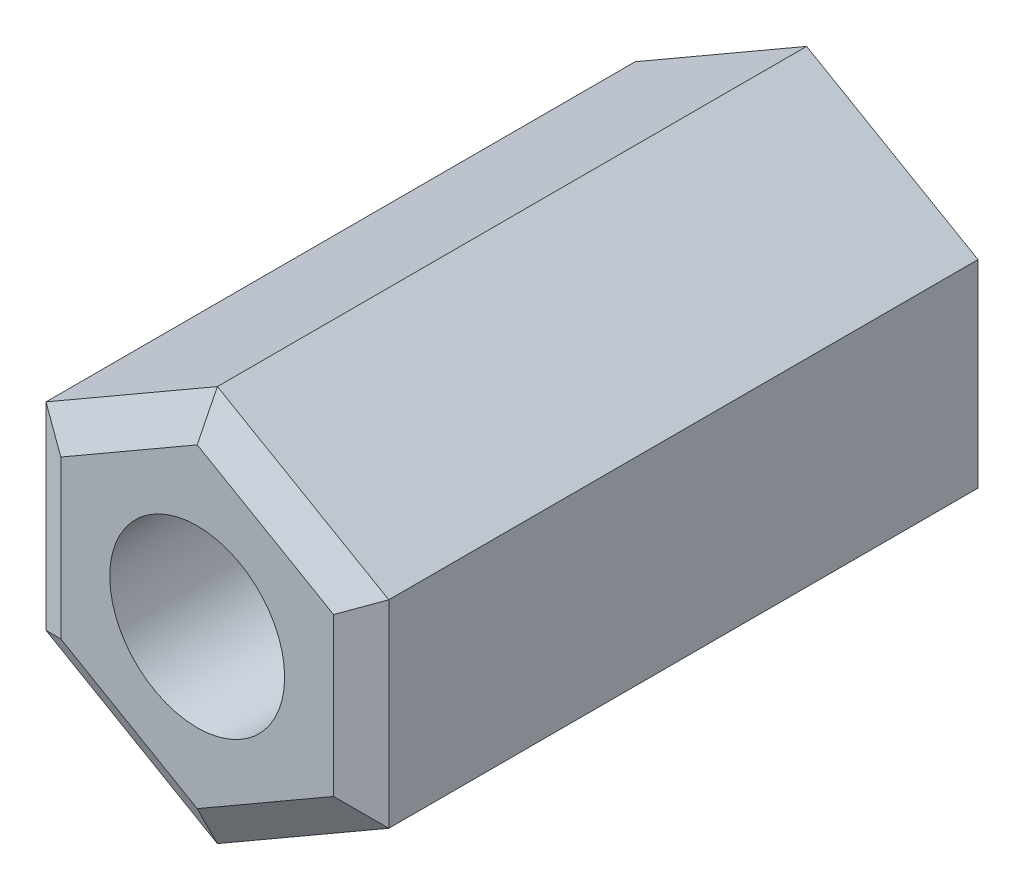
ISO-10303-21;
HEADER;
FILE_DESCRIPTION(('STEP AP214'),'2;1');
FILE_NAME('part.step','',(''),(''),'','','');
FILE_SCHEMA(('AUTOMOTIVE_DESIGN { 1 0 10303 214 1 1 1 1 }'));
ENDSEC;
DATA;
#1=APPLICATION_CONTEXT('core data for automotive mechanical design processes');
#2=APPLICATION_PROTOCOL_DEFINITION('international standard','automotive_design',2000,#1);
#3=PRODUCT_CONTEXT('',#1,'mechanical');
#4=PRODUCT('Part','Part','',(#3));
#5=PRODUCT_RELATED_PRODUCT_CATEGORY('part','',(#4));
#6=PRODUCT_DEFINITION_FORMATION('','',#4);
#7=PRODUCT_DEFINITION_CONTEXT('part definition',#1,'design');
#8=PRODUCT_DEFINITION('design','',#6,#7);
#9=PRODUCT_DEFINITION_SHAPE('','',#8);
#10=(LENGTH_UNIT() NAMED_UNIT(*) SI_UNIT(.MILLI.,.METRE.));
#11=(NAMED_UNIT(*) PLANE_ANGLE_UNIT() SI_UNIT($,.RADIAN.));
#12=(NAMED_UNIT(*) SI_UNIT($,.STERADIAN.) SOLID_ANGLE_UNIT());
#13=UNCERTAINTY_MEASURE_WITH_UNIT(LENGTH_MEASURE(1.E-05),#10,'distance_accuracy_value','');
#14=(GEOMETRIC_REPRESENTATION_CONTEXT(3) GLOBAL_UNCERTAINTY_ASSIGNED_CONTEXT((#13)) GLOBAL_UNIT_ASSIGNED_CONTEXT((#10,
#11,#12)) REPRESENTATION_CONTEXT('',''));
#15=CARTESIAN_POINT('',(0.,0.,0.));
#16=DIRECTION('',(0.,0.,1.));
#17=DIRECTION('',(1.,0.,0.));
#18=AXIS2_PLACEMENT_3D('',#15,#16,#17);
#19=CARTESIAN_POINT('',(0.,-5.65803263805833,18.));
#20=DIRECTION('',(-0.5,0.866025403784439,0.));
#21=DIRECTION('',(-0.866025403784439,-0.5,0.));
#22=AXIS2_PLACEMENT_3D('',#19,#20,#21);
#23=PLANE('',#22);
#24=DIRECTION('',(0.,0.,-1.));
#25=VECTOR('',#24,1.);
#26=CARTESIAN_POINT('',(0.,-5.65803263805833,18.));
#27=LINE('',#26,#25);
#28=CARTESIAN_POINT('',(0.,-5.65803263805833,17.4226497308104));
#29=VERTEX_POINT('',#28);
#30=CARTESIAN_POINT('',(0.,-5.65803263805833,0.577350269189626));
#31=VERTEX_POINT('',#30);
#32=EDGE_CURVE('E296',#29,#31,#27,.T.);
#33=ORIENTED_EDGE('',*,*,#32,.T.);
#34=DIRECTION('',(0.866025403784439,0.5,0.));
#35=VECTOR('',#34,1.);
#36=CARTESIAN_POINT('',(0.,-5.65803263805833,0.577350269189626));
#37=LINE('',#36,#35);
#38=CARTESIAN_POINT('',(4.9,-2.82901631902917,0.577350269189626));
#39=VERTEX_POINT('',#38);
#40=EDGE_CURVE('E198',#31,#39,#37,.T.);
#41=ORIENTED_EDGE('',*,*,#40,.T.);
#42=DIRECTION('',(0.,0.,-1.));
#43=VECTOR('',#42,1.);
#44=CARTESIAN_POINT('',(4.9,-2.82901631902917,18.));
#45=LINE('',#44,#43);
#46=CARTESIAN_POINT('',(4.9,-2.82901631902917,17.4226497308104));
#47=VERTEX_POINT('',#46);
#48=EDGE_CURVE('E168',#47,#39,#45,.T.);
#49=ORIENTED_EDGE('',*,*,#48,.F.);
#50=DIRECTION('',(-0.866025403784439,-0.5,0.));
#51=VECTOR('',#50,1.);
#52=CARTESIAN_POINT('',(0.,-5.65803263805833,17.4226497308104));
#53=LINE('',#52,#51);
#54=EDGE_CURVE('E179',#47,#29,#53,.T.);
#55=ORIENTED_EDGE('',*,*,#54,.T.);
#56=EDGE_LOOP('',(#33,#41,#49,#55));
#57=FACE_BOUND('',#56,.T.);
#58=ADVANCED_FACE('F53',(#57),#23,.F.);
#59=CARTESIAN_POINT('',(4.9,-2.82901631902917,18.));
#60=DIRECTION('',(-1.,0.,0.));
#61=DIRECTION('',(0.,-1.,0.));
#62=AXIS2_PLACEMENT_3D('',#59,#60,#61);
#63=PLANE('',#62);
#64=ORIENTED_EDGE('',*,*,#48,.T.);
#65=DIRECTION('',(0.,1.,0.));
#66=VECTOR('',#65,1.);
#67=CARTESIAN_POINT('',(4.9,-2.82901631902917,0.577350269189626));
#68=LINE('',#67,#66);
#69=CARTESIAN_POINT('',(4.9,2.82901631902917,0.577350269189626));
#70=VERTEX_POINT('',#69);
#71=EDGE_CURVE('E11',#39,#70,#68,.T.);
#72=ORIENTED_EDGE('',*,*,#71,.T.);
#73=DIRECTION('',(0.,0.,-1.));
#74=VECTOR('',#73,1.);
#75=CARTESIAN_POINT('',(4.9,2.82901631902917,18.));
#76=LINE('',#75,#74);
#77=CARTESIAN_POINT('',(4.9,2.82901631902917,17.4226497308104));
#78=VERTEX_POINT('',#77);
#79=EDGE_CURVE('E320',#78,#70,#76,.T.);
#80=ORIENTED_EDGE('',*,*,#79,.F.);
#81=DIRECTION('',(0.,-1.,0.));
#82=VECTOR('',#81,1.);
#83=CARTESIAN_POINT('',(4.9,-2.82901631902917,17.4226497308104));
#84=LINE('',#83,#82);
#85=EDGE_CURVE('E153',#78,#47,#84,.T.);
#86=ORIENTED_EDGE('',*,*,#85,.T.);
#87=EDGE_LOOP('',(#64,#72,#80,#86));
#88=FACE_BOUND('',#87,.T.);
#89=ADVANCED_FACE('F338',(#88),#63,.F.);
#90=CARTESIAN_POINT('',(4.9,2.82901631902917,18.));
#91=DIRECTION('',(-0.5,-0.866025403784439,0.));
#92=DIRECTION('',(0.866025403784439,-0.5,0.));
#93=AXIS2_PLACEMENT_3D('',#90,#91,#92);
#94=PLANE('',#93);
#95=ORIENTED_EDGE('',*,*,#79,.T.);
#96=DIRECTION('',(-0.866025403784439,0.5,0.));
#97=VECTOR('',#96,1.);
#98=CARTESIAN_POINT('',(4.9,2.82901631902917,0.577350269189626));
#99=LINE('',#98,#97);
#100=CARTESIAN_POINT('',(0.,5.65803263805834,0.577350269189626));
#101=VERTEX_POINT('',#100);
#102=EDGE_CURVE('E64',#70,#101,#99,.T.);
#103=ORIENTED_EDGE('',*,*,#102,.T.);
#104=DIRECTION('',(0.,0.,-1.));
#105=VECTOR('',#104,1.);
#106=CARTESIAN_POINT('',(0.,5.65803263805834,18.));
#107=LINE('',#106,#105);
#108=CARTESIAN_POINT('',(0.,5.65803263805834,17.4226497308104));
#109=VERTEX_POINT('',#108);
#110=EDGE_CURVE('E317',#109,#101,#107,.T.);
#111=ORIENTED_EDGE('',*,*,#110,.F.);
#112=DIRECTION('',(0.866025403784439,-0.5,0.));
#113=VECTOR('',#112,1.);
#114=CARTESIAN_POINT('',(4.9,2.82901631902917,17.4226497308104));
#115=LINE('',#114,#113);
#116=EDGE_CURVE('E196',#109,#78,#115,.T.);
#117=ORIENTED_EDGE('',*,*,#116,.T.);
#118=EDGE_LOOP('',(#95,#103,#111,#117));
#119=FACE_BOUND('',#118,.T.);
#120=ADVANCED_FACE('F339',(#119),#94,.F.);
#121=CARTESIAN_POINT('',(0.,5.65803263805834,18.));
#122=DIRECTION('',(0.5,-0.866025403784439,0.));
#123=DIRECTION('',(0.866025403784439,0.5,0.));
#124=AXIS2_PLACEMENT_3D('',#121,#122,#123);
#125=PLANE('',#124);
#126=ORIENTED_EDGE('',*,*,#110,.T.);
#127=DIRECTION('',(-0.866025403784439,-0.5,0.));
#128=VECTOR('',#127,1.);
#129=CARTESIAN_POINT('',(0.,5.65803263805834,0.577350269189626));
#130=LINE('',#129,#128);
#131=CARTESIAN_POINT('',(-4.9,2.82901631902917,0.577350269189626));
#132=VERTEX_POINT('',#131);
#133=EDGE_CURVE('E245',#101,#132,#130,.T.);
#134=ORIENTED_EDGE('',*,*,#133,.T.);
#135=DIRECTION('',(0.,0.,-1.));
#136=VECTOR('',#135,1.);
#137=CARTESIAN_POINT('',(-4.9,2.82901631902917,18.));
#138=LINE('',#137,#136);
#139=CARTESIAN_POINT('',(-4.9,2.82901631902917,17.4226497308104));
#140=VERTEX_POINT('',#139);
#141=EDGE_CURVE('E308',#140,#132,#138,.T.);
#142=ORIENTED_EDGE('',*,*,#141,.F.);
#143=DIRECTION('',(0.866025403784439,0.5,0.));
#144=VECTOR('',#143,1.);
#145=CARTESIAN_POINT('',(0.,5.65803263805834,17.4226497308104));
#146=LINE('',#145,#144);
#147=EDGE_CURVE('E193',#140,#109,#146,.T.);
#148=ORIENTED_EDGE('',*,*,#147,.T.);
#149=EDGE_LOOP('',(#126,#134,#142,#148));
#150=FACE_BOUND('',#149,.T.);
#151=ADVANCED_FACE('F407',(#150),#125,.F.);
#152=CARTESIAN_POINT('',(-4.9,2.82901631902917,18.));
#153=DIRECTION('',(1.,0.,0.));
#154=DIRECTION('',(0.,1.,0.));
#155=AXIS2_PLACEMENT_3D('',#152,#153,#154);
#156=PLANE('',#155);
#157=ORIENTED_EDGE('',*,*,#141,.T.);
#158=DIRECTION('',(0.,-1.,0.));
#159=VECTOR('',#158,1.);
#160=CARTESIAN_POINT('',(-4.9,2.82901631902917,0.577350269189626));
#161=LINE('',#160,#159);
#162=CARTESIAN_POINT('',(-4.9,-2.82901631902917,0.577350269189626));
#163=VERTEX_POINT('',#162);
#164=EDGE_CURVE('E242',#132,#163,#161,.T.);
#165=ORIENTED_EDGE('',*,*,#164,.T.);
#166=DIRECTION('',(0.,0.,-1.));
#167=VECTOR('',#166,1.);
#168=CARTESIAN_POINT('',(-4.9,-2.82901631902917,18.));
#169=LINE('',#168,#167);
#170=CARTESIAN_POINT('',(-4.9,-2.82901631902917,17.4226497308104));
#171=VERTEX_POINT('',#170);
#172=EDGE_CURVE('E299',#171,#163,#169,.T.);
#173=ORIENTED_EDGE('',*,*,#172,.F.);
#174=DIRECTION('',(0.,1.,0.));
#175=VECTOR('',#174,1.);
#176=CARTESIAN_POINT('',(-4.9,2.82901631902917,17.4226497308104));
#177=LINE('',#176,#175);
#178=EDGE_CURVE('E190',#171,#140,#177,.T.);
#179=ORIENTED_EDGE('',*,*,#178,.T.);
#180=EDGE_LOOP('',(#157,#165,#173,#179));
#181=FACE_BOUND('',#180,.T.);
#182=ADVANCED_FACE('F409',(#181),#156,.F.);
#183=CARTESIAN_POINT('',(-4.9,-2.82901631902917,18.));
#184=DIRECTION('',(0.5,0.866025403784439,0.));
#185=DIRECTION('',(-0.866025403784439,0.5,0.));
#186=AXIS2_PLACEMENT_3D('',#183,#184,#185);
#187=PLANE('',#186);
#188=ORIENTED_EDGE('',*,*,#172,.T.);
#189=DIRECTION('',(0.866025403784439,-0.5,0.));
#190=VECTOR('',#189,1.);
#191=CARTESIAN_POINT('',(-4.9,-2.82901631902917,0.577350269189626));
#192=LINE('',#191,#190);
#193=EDGE_CURVE('E239',#163,#31,#192,.T.);
#194=ORIENTED_EDGE('',*,*,#193,.T.);
#195=ORIENTED_EDGE('',*,*,#32,.F.);
#196=DIRECTION('',(-0.866025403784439,0.5,0.));
#197=VECTOR('',#196,1.);
#198=CARTESIAN_POINT('',(-4.9,-2.82901631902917,17.4226497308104));
#199=LINE('',#198,#197);
#200=EDGE_CURVE('E187',#29,#171,#199,.T.);
#201=ORIENTED_EDGE('',*,*,#200,.T.);
#202=EDGE_LOOP('',(#188,#194,#195,#201));
#203=FACE_BOUND('',#202,.T.);
#204=ADVANCED_FACE('F295',(#203),#187,.F.);
#205=CARTESIAN_POINT('',(0.,0.,18.));
#206=DIRECTION('',(0.,0.,1.));
#207=DIRECTION('',(1.,0.,0.));
#208=AXIS2_PLACEMENT_3D('',#205,#206,#207);
#209=PLANE('',#208);
#210=DIRECTION('',(0.866025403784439,0.5,0.));
#211=VECTOR('',#210,1.);
#212=CARTESIAN_POINT('',(4.4,-1.96299091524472,18.));
#213=LINE('',#212,#211);
#214=CARTESIAN_POINT('',(0.,-4.50333209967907,18.));
#215=VERTEX_POINT('',#214);
#216=CARTESIAN_POINT('',(3.89999999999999,-2.25166604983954,18.));
#217=VERTEX_POINT('',#216);
#218=EDGE_CURVE('E173',#215,#217,#213,.T.);
#219=ORIENTED_EDGE('',*,*,#218,.T.);
#220=DIRECTION('',(0.,1.,0.));
#221=VECTOR('',#220,1.);
#222=CARTESIAN_POINT('',(3.89999999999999,2.82901631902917,18.));
#223=LINE('',#222,#221);
#224=CARTESIAN_POINT('',(3.89999999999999,2.25166604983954,18.));
#225=VERTEX_POINT('',#224);
#226=EDGE_CURVE('E151',#217,#225,#223,.T.);
#227=ORIENTED_EDGE('',*,*,#226,.T.);
#228=DIRECTION('',(-0.866025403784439,0.5,0.));
#229=VECTOR('',#228,1.);
#230=CARTESIAN_POINT('',(-0.500000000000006,4.79200723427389,18.));
#231=LINE('',#230,#229);
#232=CARTESIAN_POINT('',(0.,4.50333209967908,18.));
#233=VERTEX_POINT('',#232);
#234=EDGE_CURVE('E160',#225,#233,#231,.T.);
#235=ORIENTED_EDGE('',*,*,#234,.T.);
#236=DIRECTION('',(-0.866025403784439,-0.5,0.));
#237=VECTOR('',#236,1.);
#238=CARTESIAN_POINT('',(-4.4,1.96299091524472,18.));
#239=LINE('',#238,#237);
#240=CARTESIAN_POINT('',(-3.89999999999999,2.25166604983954,18.));
#241=VERTEX_POINT('',#240);
#242=EDGE_CURVE('E167',#233,#241,#239,.T.);
#243=ORIENTED_EDGE('',*,*,#242,.T.);
#244=DIRECTION('',(0.,-1.,0.));
#245=VECTOR('',#244,1.);
#246=CARTESIAN_POINT('',(-3.89999999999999,-2.82901631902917,18.));
#247=LINE('',#246,#245);
#248=CARTESIAN_POINT('',(-3.89999999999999,-2.25166604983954,18.));
#249=VERTEX_POINT('',#248);
#250=EDGE_CURVE('E327',#241,#249,#247,.T.);
#251=ORIENTED_EDGE('',*,*,#250,.T.);
#252=DIRECTION('',(0.866025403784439,-0.5,0.));
#253=VECTOR('',#252,1.);
#254=CARTESIAN_POINT('',(0.500000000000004,-4.79200723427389,18.));
#255=LINE('',#254,#253);
#256=EDGE_CURVE('E181',#249,#215,#255,.T.);
#257=ORIENTED_EDGE('',*,*,#256,.T.);
#258=EDGE_LOOP('',(#219,#227,#235,#243,#251,#257));
#259=FACE_BOUND('',#258,.T.);
#260=CARTESIAN_POINT('',(0.,0.,18.));
#261=DIRECTION('',(0.,0.,1.));
#262=DIRECTION('',(1.,0.,0.));
#263=AXIS2_PLACEMENT_3D('',#260,#261,#262);
#264=CIRCLE('',#263,2.5);
#265=CARTESIAN_POINT('',(2.5,0.,18.));
#266=VERTEX_POINT('',#265);
#267=EDGE_CURVE('E216',#266,#266,#264,.T.);
#268=ORIENTED_EDGE('',*,*,#267,.F.);
#269=EDGE_LOOP('',(#268));
#270=FACE_BOUND('',#269,.T.);
#271=ADVANCED_FACE('F170',(#259,#270),#209,.T.);
#272=CARTESIAN_POINT('',(0.,0.,0.));
#273=DIRECTION('',(0.,0.,1.));
#274=DIRECTION('',(1.,0.,0.));
#275=AXIS2_PLACEMENT_3D('',#272,#273,#274);
#276=PLANE('',#275);
#277=DIRECTION('',(0.,-1.,0.));
#278=VECTOR('',#277,1.);
#279=CARTESIAN_POINT('',(3.89999999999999,0.,0.));
#280=LINE('',#279,#278);
#281=CARTESIAN_POINT('',(3.89999999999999,2.25166604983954,0.));
#282=VERTEX_POINT('',#281);
#283=CARTESIAN_POINT('',(3.89999999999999,-2.25166604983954,0.));
#284=VERTEX_POINT('',#283);
#285=EDGE_CURVE('E220',#282,#284,#280,.T.);
#286=ORIENTED_EDGE('',*,*,#285,.T.);
#287=DIRECTION('',(-0.866025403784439,-0.5,0.));
#288=VECTOR('',#287,1.);
#289=CARTESIAN_POINT('',(1.95,-3.37749907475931,0.));
#290=LINE('',#289,#288);
#291=CARTESIAN_POINT('',(0.,-4.50333209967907,0.));
#292=VERTEX_POINT('',#291);
#293=EDGE_CURVE('E235',#284,#292,#290,.T.);
#294=ORIENTED_EDGE('',*,*,#293,.T.);
#295=DIRECTION('',(-0.866025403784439,0.5,0.));
#296=VECTOR('',#295,1.);
#297=CARTESIAN_POINT('',(-1.95,-3.37749907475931,0.));
#298=LINE('',#297,#296);
#299=CARTESIAN_POINT('',(-3.89999999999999,-2.25166604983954,0.));
#300=VERTEX_POINT('',#299);
#301=EDGE_CURVE('E232',#292,#300,#298,.T.);
#302=ORIENTED_EDGE('',*,*,#301,.T.);
#303=DIRECTION('',(0.,1.,0.));
#304=VECTOR('',#303,1.);
#305=CARTESIAN_POINT('',(-3.89999999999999,0.,0.));
#306=LINE('',#305,#304);
#307=CARTESIAN_POINT('',(-3.89999999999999,2.25166604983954,0.));
#308=VERTEX_POINT('',#307);
#309=EDGE_CURVE('E229',#300,#308,#306,.T.);
#310=ORIENTED_EDGE('',*,*,#309,.T.);
#311=DIRECTION('',(0.866025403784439,0.5,0.));
#312=VECTOR('',#311,1.);
#313=CARTESIAN_POINT('',(-1.95,3.37749907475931,0.));
#314=LINE('',#313,#312);
#315=CARTESIAN_POINT('',(0.,4.50333209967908,0.));
#316=VERTEX_POINT('',#315);
#317=EDGE_CURVE('E226',#308,#316,#314,.T.);
#318=ORIENTED_EDGE('',*,*,#317,.T.);
#319=DIRECTION('',(0.866025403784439,-0.5,0.));
#320=VECTOR('',#319,1.);
#321=CARTESIAN_POINT('',(1.95,3.37749907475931,0.));
#322=LINE('',#321,#320);
#323=EDGE_CURVE('E223',#316,#282,#322,.T.);
#324=ORIENTED_EDGE('',*,*,#323,.T.);
#325=EDGE_LOOP('',(#286,#294,#302,#310,#318,#324));
#326=FACE_BOUND('',#325,.T.);
#327=CARTESIAN_POINT('',(0.,0.,0.));
#328=DIRECTION('',(0.,0.,1.));
#329=DIRECTION('',(1.,0.,0.));
#330=AXIS2_PLACEMENT_3D('',#327,#328,#329);
#331=CIRCLE('',#330,2.5);
#332=CARTESIAN_POINT('',(2.5,0.,0.));
#333=VERTEX_POINT('',#332);
#334=EDGE_CURVE('E304',#333,#333,#331,.T.);
#335=ORIENTED_EDGE('',*,*,#334,.T.);
#336=EDGE_LOOP('',(#335));
#337=FACE_BOUND('',#336,.T.);
#338=ADVANCED_FACE('F281',(#326,#337),#276,.F.);
#339=CARTESIAN_POINT('',(0.,0.,18.));
#340=DIRECTION('',(0.,0.,1.));
#341=DIRECTION('',(1.,0.,0.));
#342=AXIS2_PLACEMENT_3D('',#339,#340,#341);
#343=CYLINDRICAL_SURFACE('',#342,2.5);
#344=ORIENTED_EDGE('',*,*,#334,.F.);
#345=EDGE_LOOP('',(#344));
#346=FACE_BOUND('',#345,.T.);
#347=ORIENTED_EDGE('',*,*,#267,.T.);
#348=EDGE_LOOP('',(#347));
#349=FACE_BOUND('',#348,.T.);
#350=ADVANCED_FACE('F394',(#346,#349),#343,.F.);
#351=CARTESIAN_POINT('',(-3.89999999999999,0.,18.));
#352=DIRECTION('',(-0.499999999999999,0.,0.866025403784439));
#353=DIRECTION('',(0.,1.,0.));
#354=AXIS2_PLACEMENT_3D('',#351,#352,#353);
#355=PLANE('',#354);
#356=DIRECTION('',(0.774596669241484,-0.447213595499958,0.447213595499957));
#357=VECTOR('',#356,1.);
#358=CARTESIAN_POINT('',(-3.11999999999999,1.80133283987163,18.4503332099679));
#359=LINE('',#358,#357);
#360=EDGE_CURVE('E208',#140,#241,#359,.T.);
#361=ORIENTED_EDGE('',*,*,#360,.F.);
#362=ORIENTED_EDGE('',*,*,#178,.F.);
#363=DIRECTION('',(0.774596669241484,0.447213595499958,0.447213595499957));
#364=VECTOR('',#363,1.);
#365=CARTESIAN_POINT('',(-3.11999999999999,-1.80133283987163,18.4503332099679));
#366=LINE('',#365,#364);
#367=EDGE_CURVE('E212',#249,#171,#366,.F.);
#368=ORIENTED_EDGE('',*,*,#367,.F.);
#369=ORIENTED_EDGE('',*,*,#250,.F.);
#370=EDGE_LOOP('',(#361,#362,#368,#369));
#371=FACE_BOUND('',#370,.T.);
#372=ADVANCED_FACE('F390',(#371),#355,.T.);
#373=CARTESIAN_POINT('',(-1.95,-3.37749907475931,18.));
#374=DIRECTION('',(-0.25,-0.433012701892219,0.866025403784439));
#375=DIRECTION('',(-0.866025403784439,0.5,0.));
#376=AXIS2_PLACEMENT_3D('',#373,#374,#375);
#377=PLANE('',#376);
#378=ORIENTED_EDGE('',*,*,#367,.T.);
#379=ORIENTED_EDGE('',*,*,#200,.F.);
#380=DIRECTION('',(0.,0.894427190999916,0.447213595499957));
#381=VECTOR('',#380,1.);
#382=CARTESIAN_POINT('',(0.,-3.60266567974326,18.4503332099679));
#383=LINE('',#382,#381);
#384=EDGE_CURVE('E204',#215,#29,#383,.F.);
#385=ORIENTED_EDGE('',*,*,#384,.F.);
#386=ORIENTED_EDGE('',*,*,#256,.F.);
#387=EDGE_LOOP('',(#378,#379,#385,#386));
#388=FACE_BOUND('',#387,.T.);
#389=ADVANCED_FACE('F335',(#388),#377,.T.);
#390=CARTESIAN_POINT('',(-1.95,3.37749907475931,18.));
#391=DIRECTION('',(-0.25,0.433012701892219,0.866025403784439));
#392=DIRECTION('',(0.866025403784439,0.5,0.));
#393=AXIS2_PLACEMENT_3D('',#390,#391,#392);
#394=PLANE('',#393);
#395=ORIENTED_EDGE('',*,*,#360,.T.);
#396=ORIENTED_EDGE('',*,*,#242,.F.);
#397=DIRECTION('',(0.,-0.894427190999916,0.447213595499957));
#398=VECTOR('',#397,1.);
#399=CARTESIAN_POINT('',(0.,3.60266567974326,18.4503332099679));
#400=LINE('',#399,#398);
#401=EDGE_CURVE('E163',#109,#233,#400,.T.);
#402=ORIENTED_EDGE('',*,*,#401,.F.);
#403=ORIENTED_EDGE('',*,*,#147,.F.);
#404=EDGE_LOOP('',(#395,#396,#402,#403));
#405=FACE_BOUND('',#404,.T.);
#406=ADVANCED_FACE('F379',(#405),#394,.T.);
#407=CARTESIAN_POINT('',(1.95,-3.37749907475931,18.));
#408=DIRECTION('',(0.25,-0.433012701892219,0.866025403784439));
#409=DIRECTION('',(-0.866025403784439,-0.5,0.));
#410=AXIS2_PLACEMENT_3D('',#407,#408,#409);
#411=PLANE('',#410);
#412=ORIENTED_EDGE('',*,*,#384,.T.);
#413=ORIENTED_EDGE('',*,*,#54,.F.);
#414=DIRECTION('',(-0.774596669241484,0.447213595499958,0.447213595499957));
#415=VECTOR('',#414,1.);
#416=CARTESIAN_POINT('',(3.11999999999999,-1.80133283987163,18.4503332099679));
#417=LINE('',#416,#415);
#418=EDGE_CURVE('E157',#217,#47,#417,.F.);
#419=ORIENTED_EDGE('',*,*,#418,.F.);
#420=ORIENTED_EDGE('',*,*,#218,.F.);
#421=EDGE_LOOP('',(#412,#413,#419,#420));
#422=FACE_BOUND('',#421,.T.);
#423=ADVANCED_FACE('F337',(#422),#411,.T.);
#424=CARTESIAN_POINT('',(1.95,3.37749907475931,18.));
#425=DIRECTION('',(0.25,0.433012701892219,0.866025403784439));
#426=DIRECTION('',(0.866025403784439,-0.5,0.));
#427=AXIS2_PLACEMENT_3D('',#424,#425,#426);
#428=PLANE('',#427);
#429=ORIENTED_EDGE('',*,*,#401,.T.);
#430=ORIENTED_EDGE('',*,*,#234,.F.);
#431=DIRECTION('',(0.774596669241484,0.447213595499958,-0.447213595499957));
#432=VECTOR('',#431,1.);
#433=CARTESIAN_POINT('',(3.11999999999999,1.80133283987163,18.4503332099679));
#434=LINE('',#433,#432);
#435=EDGE_CURVE('E147',#78,#225,#434,.F.);
#436=ORIENTED_EDGE('',*,*,#435,.F.);
#437=ORIENTED_EDGE('',*,*,#116,.F.);
#438=EDGE_LOOP('',(#429,#430,#436,#437));
#439=FACE_BOUND('',#438,.T.);
#440=ADVANCED_FACE('F161',(#439),#428,.T.);
#441=CARTESIAN_POINT('',(3.89999999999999,0.,18.));
#442=DIRECTION('',(0.499999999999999,0.,0.866025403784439));
#443=DIRECTION('',(0.,-1.,0.));
#444=AXIS2_PLACEMENT_3D('',#441,#442,#443);
#445=PLANE('',#444);
#446=ORIENTED_EDGE('',*,*,#418,.T.);
#447=ORIENTED_EDGE('',*,*,#85,.F.);
#448=ORIENTED_EDGE('',*,*,#435,.T.);
#449=ORIENTED_EDGE('',*,*,#226,.F.);
#450=EDGE_LOOP('',(#446,#447,#448,#449));
#451=FACE_BOUND('',#450,.T.);
#452=ADVANCED_FACE('F149',(#451),#445,.T.);
#453=CARTESIAN_POINT('',(0.,5.65803263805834,0.577350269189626));
#454=DIRECTION('',(0.249999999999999,-0.433012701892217,0.86602540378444));
#455=DIRECTION('',(-0.866025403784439,-0.5,0.));
#456=AXIS2_PLACEMENT_3D('',#453,#454,#455);
#457=PLANE('',#456);
#458=DIRECTION('',(0.,0.894427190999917,0.447213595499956));
#459=VECTOR('',#458,1.);
#460=CARTESIAN_POINT('',(0.,3.394819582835,-0.554256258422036));
#461=LINE('',#460,#459);
#462=EDGE_CURVE('E263',#316,#101,#461,.T.);
#463=ORIENTED_EDGE('',*,*,#462,.F.);
#464=ORIENTED_EDGE('',*,*,#317,.F.);
#465=DIRECTION('',(-0.774596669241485,0.447213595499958,0.447213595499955));
#466=VECTOR('',#465,1.);
#467=CARTESIAN_POINT('',(-2.93999999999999,1.6974097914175,-0.554256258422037));
#468=LINE('',#467,#466);
#469=EDGE_CURVE('E58',#132,#308,#468,.F.);
#470=ORIENTED_EDGE('',*,*,#469,.F.);
#471=ORIENTED_EDGE('',*,*,#133,.F.);
#472=EDGE_LOOP('',(#463,#464,#470,#471));
#473=FACE_BOUND('',#472,.T.);
#474=ADVANCED_FACE('F56',(#473),#457,.F.);
#475=CARTESIAN_POINT('',(-4.9,2.82901631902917,0.577350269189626));
#476=DIRECTION('',(0.499999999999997,0.,0.86602540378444));
#477=DIRECTION('',(0.,-1.,0.));
#478=AXIS2_PLACEMENT_3D('',#475,#476,#477);
#479=PLANE('',#478);
#480=ORIENTED_EDGE('',*,*,#469,.T.);
#481=ORIENTED_EDGE('',*,*,#309,.F.);
#482=DIRECTION('',(-0.774596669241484,-0.447213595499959,0.447213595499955));
#483=VECTOR('',#482,1.);
#484=CARTESIAN_POINT('',(-2.93999999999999,-1.6974097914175,-0.554256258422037));
#485=LINE('',#484,#483);
#486=EDGE_CURVE('E260',#163,#300,#485,.F.);
#487=ORIENTED_EDGE('',*,*,#486,.F.);
#488=ORIENTED_EDGE('',*,*,#164,.F.);
#489=EDGE_LOOP('',(#480,#481,#487,#488));
#490=FACE_BOUND('',#489,.T.);
#491=ADVANCED_FACE('F275',(#490),#479,.F.);
#492=CARTESIAN_POINT('',(4.9,2.82901631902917,0.577350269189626));
#493=DIRECTION('',(-0.249999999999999,-0.433012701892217,0.86602540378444));
#494=DIRECTION('',(-0.866025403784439,0.5,0.));
#495=AXIS2_PLACEMENT_3D('',#492,#493,#494);
#496=PLANE('',#495);
#497=ORIENTED_EDGE('',*,*,#462,.T.);
#498=ORIENTED_EDGE('',*,*,#102,.F.);
#499=DIRECTION('',(0.774596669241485,0.447213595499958,0.447213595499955));
#500=VECTOR('',#499,1.);
#501=CARTESIAN_POINT('',(2.93999999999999,1.6974097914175,-0.554256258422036));
#502=LINE('',#501,#500);
#503=EDGE_CURVE('E256',#282,#70,#502,.T.);
#504=ORIENTED_EDGE('',*,*,#503,.F.);
#505=ORIENTED_EDGE('',*,*,#323,.F.);
#506=EDGE_LOOP('',(#497,#498,#504,#505));
#507=FACE_BOUND('',#506,.T.);
#508=ADVANCED_FACE('F340',(#507),#496,.F.);
#509=CARTESIAN_POINT('',(-4.9,-2.82901631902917,0.577350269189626));
#510=DIRECTION('',(0.249999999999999,0.433012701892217,0.86602540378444));
#511=DIRECTION('',(0.866025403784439,-0.5,0.));
#512=AXIS2_PLACEMENT_3D('',#509,#510,#511);
#513=PLANE('',#512);
#514=ORIENTED_EDGE('',*,*,#486,.T.);
#515=ORIENTED_EDGE('',*,*,#301,.F.);
#516=DIRECTION('',(0.,-0.894427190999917,0.447213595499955));
#517=VECTOR('',#516,1.);
#518=CARTESIAN_POINT('',(0.,-3.39481958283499,-0.554256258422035));
#519=LINE('',#518,#517);
#520=EDGE_CURVE('E253',#31,#292,#519,.F.);
#521=ORIENTED_EDGE('',*,*,#520,.F.);
#522=ORIENTED_EDGE('',*,*,#193,.F.);
#523=EDGE_LOOP('',(#514,#515,#521,#522));
#524=FACE_BOUND('',#523,.T.);
#525=ADVANCED_FACE('F288',(#524),#513,.F.);
#526=CARTESIAN_POINT('',(4.9,-2.82901631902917,0.577350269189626));
#527=DIRECTION('',(-0.499999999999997,0.,0.86602540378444));
#528=DIRECTION('',(0.,1.,0.));
#529=AXIS2_PLACEMENT_3D('',#526,#527,#528);
#530=PLANE('',#529);
#531=ORIENTED_EDGE('',*,*,#503,.T.);
#532=ORIENTED_EDGE('',*,*,#71,.F.);
#533=DIRECTION('',(-0.774596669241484,0.447213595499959,-0.447213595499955));
#534=VECTOR('',#533,1.);
#535=CARTESIAN_POINT('',(4.9,-2.82901631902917,0.577350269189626));
#536=LINE('',#535,#534);
#537=EDGE_CURVE('E250',#284,#39,#536,.F.);
#538=ORIENTED_EDGE('',*,*,#537,.F.);
#539=ORIENTED_EDGE('',*,*,#285,.F.);
#540=EDGE_LOOP('',(#531,#532,#538,#539));
#541=FACE_BOUND('',#540,.T.);
#542=ADVANCED_FACE('F343',(#541),#530,.F.);
#543=CARTESIAN_POINT('',(0.,-5.65803263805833,0.577350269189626));
#544=DIRECTION('',(-0.249999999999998,0.433012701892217,0.86602540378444));
#545=DIRECTION('',(0.866025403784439,0.5,0.));
#546=AXIS2_PLACEMENT_3D('',#543,#544,#545);
#547=PLANE('',#546);
#548=ORIENTED_EDGE('',*,*,#520,.T.);
#549=ORIENTED_EDGE('',*,*,#293,.F.);
#550=ORIENTED_EDGE('',*,*,#537,.T.);
#551=ORIENTED_EDGE('',*,*,#40,.F.);
#552=EDGE_LOOP('',(#548,#549,#550,#551));
#553=FACE_BOUND('',#552,.T.);
#554=ADVANCED_FACE('F346',(#553),#547,.F.);
#555=CLOSED_SHELL('',(#58,#89,#120,#151,#182,#204,#271,#338,#350,#372,#389,#406,#423,#440,#452,
#474,#491,#508,#525,#542,#554));
#556=MANIFOLD_SOLID_BREP('B2',#555);
#557=ADVANCED_BREP_SHAPE_REPRESENTATION('',(#18,#556),#14);
#558=SHAPE_DEFINITION_REPRESENTATION(#9,#557);
ENDSEC;
END-ISO-10303-21;
